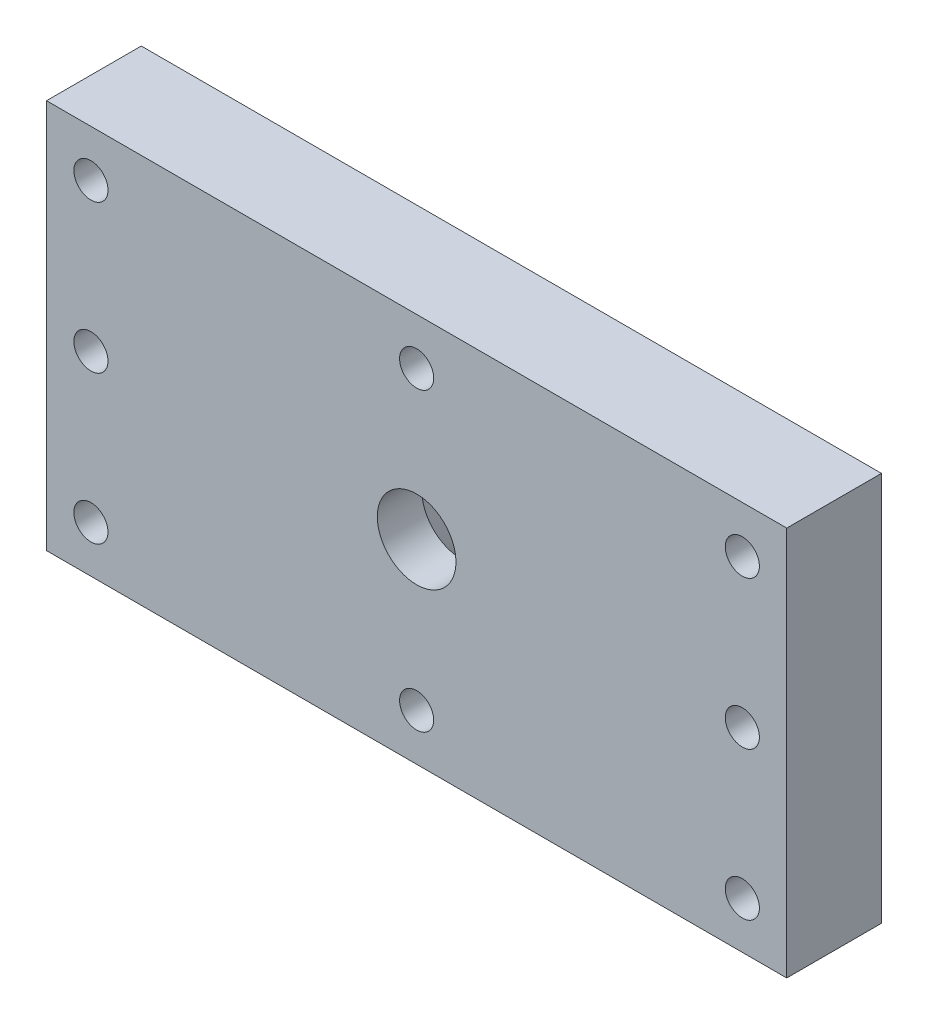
ISO-10303-21;
HEADER;
FILE_DESCRIPTION(('STEP AP214'),'2;1');
FILE_NAME('part.step','',(''),(''),'','','');
FILE_SCHEMA(('AUTOMOTIVE_DESIGN { 1 0 10303 214 1 1 1 1 }'));
ENDSEC;
DATA;
#1=APPLICATION_CONTEXT('core data for automotive mechanical design processes');
#2=APPLICATION_PROTOCOL_DEFINITION('international standard','automotive_design',2000,#1);
#3=PRODUCT_CONTEXT('',#1,'mechanical');
#4=PRODUCT('Part','Part','',(#3));
#5=PRODUCT_RELATED_PRODUCT_CATEGORY('part','',(#4));
#6=PRODUCT_DEFINITION_FORMATION('','',#4);
#7=PRODUCT_DEFINITION_CONTEXT('part definition',#1,'design');
#8=PRODUCT_DEFINITION('design','',#6,#7);
#9=PRODUCT_DEFINITION_SHAPE('','',#8);
#10=(LENGTH_UNIT() NAMED_UNIT(*) SI_UNIT(.MILLI.,.METRE.));
#11=(NAMED_UNIT(*) PLANE_ANGLE_UNIT() SI_UNIT($,.RADIAN.));
#12=(NAMED_UNIT(*) SI_UNIT($,.STERADIAN.) SOLID_ANGLE_UNIT());
#13=UNCERTAINTY_MEASURE_WITH_UNIT(LENGTH_MEASURE(1.E-05),#10,'distance_accuracy_value','');
#14=(GEOMETRIC_REPRESENTATION_CONTEXT(3) GLOBAL_UNCERTAINTY_ASSIGNED_CONTEXT((#13)) GLOBAL_UNIT_ASSIGNED_CONTEXT((#10,
#11,#12)) REPRESENTATION_CONTEXT('',''));
#15=CARTESIAN_POINT('',(0.,0.,0.));
#16=DIRECTION('',(0.,0.,1.));
#17=DIRECTION('',(1.,0.,0.));
#18=AXIS2_PLACEMENT_3D('',#15,#16,#17);
#19=CARTESIAN_POINT('',(39.6875,20.8915,10.16));
#20=DIRECTION('',(-1.,0.,0.));
#21=DIRECTION('',(0.,0.,1.));
#22=AXIS2_PLACEMENT_3D('',#19,#20,#21);
#23=PLANE('',#22);
#24=DIRECTION('',(0.,1.,0.));
#25=VECTOR('',#24,1.);
#26=CARTESIAN_POINT('',(39.6875,20.8915,0.));
#27=LINE('',#26,#25);
#28=CARTESIAN_POINT('',(39.6875,-20.8915,0.));
#29=VERTEX_POINT('',#28);
#30=CARTESIAN_POINT('',(39.6875,20.8915,0.));
#31=VERTEX_POINT('',#30);
#32=EDGE_CURVE('E96',#29,#31,#27,.T.);
#33=ORIENTED_EDGE('',*,*,#32,.T.);
#34=DIRECTION('',(0.,0.,-1.));
#35=VECTOR('',#34,1.);
#36=CARTESIAN_POINT('',(39.6875,20.8915,10.16));
#37=LINE('',#36,#35);
#38=CARTESIAN_POINT('',(39.6875,20.8915,10.16));
#39=VERTEX_POINT('',#38);
#40=EDGE_CURVE('E11',#39,#31,#37,.T.);
#41=ORIENTED_EDGE('',*,*,#40,.F.);
#42=DIRECTION('',(0.,1.,0.));
#43=VECTOR('',#42,1.);
#44=CARTESIAN_POINT('',(39.6875,20.8915,10.16));
#45=LINE('',#44,#43);
#46=CARTESIAN_POINT('',(39.6875,-20.8915,10.16));
#47=VERTEX_POINT('',#46);
#48=EDGE_CURVE('E84',#47,#39,#45,.T.);
#49=ORIENTED_EDGE('',*,*,#48,.F.);
#50=DIRECTION('',(0.,0.,-1.));
#51=VECTOR('',#50,1.);
#52=CARTESIAN_POINT('',(39.6875,-20.8915,10.16));
#53=LINE('',#52,#51);
#54=EDGE_CURVE('E92',#47,#29,#53,.T.);
#55=ORIENTED_EDGE('',*,*,#54,.T.);
#56=EDGE_LOOP('',(#33,#41,#49,#55));
#57=FACE_BOUND('',#56,.T.);
#58=ADVANCED_FACE('F33',(#57),#23,.F.);
#59=CARTESIAN_POINT('',(-39.6875,20.8915,10.16));
#60=DIRECTION('',(0.,-1.,0.));
#61=DIRECTION('',(0.,0.,-1.));
#62=AXIS2_PLACEMENT_3D('',#59,#60,#61);
#63=PLANE('',#62);
#64=DIRECTION('',(-1.,0.,0.));
#65=VECTOR('',#64,1.);
#66=CARTESIAN_POINT('',(-39.6875,20.8915,0.));
#67=LINE('',#66,#65);
#68=CARTESIAN_POINT('',(-39.6875,20.8915,0.));
#69=VERTEX_POINT('',#68);
#70=EDGE_CURVE('E88',#31,#69,#67,.T.);
#71=ORIENTED_EDGE('',*,*,#70,.T.);
#72=DIRECTION('',(0.,0.,-1.));
#73=VECTOR('',#72,1.);
#74=CARTESIAN_POINT('',(-39.6875,20.8915,10.16));
#75=LINE('',#74,#73);
#76=CARTESIAN_POINT('',(-39.6875,20.8915,10.16));
#77=VERTEX_POINT('',#76);
#78=EDGE_CURVE('E41',#77,#69,#75,.T.);
#79=ORIENTED_EDGE('',*,*,#78,.F.);
#80=DIRECTION('',(-1.,0.,0.));
#81=VECTOR('',#80,1.);
#82=CARTESIAN_POINT('',(-39.6875,20.8915,10.16));
#83=LINE('',#82,#81);
#84=EDGE_CURVE('E79',#39,#77,#83,.T.);
#85=ORIENTED_EDGE('',*,*,#84,.F.);
#86=ORIENTED_EDGE('',*,*,#40,.T.);
#87=EDGE_LOOP('',(#71,#79,#85,#86));
#88=FACE_BOUND('',#87,.T.);
#89=ADVANCED_FACE('F87',(#88),#63,.F.);
#90=CARTESIAN_POINT('',(-39.6875,20.8915,10.16));
#91=DIRECTION('',(1.,0.,0.));
#92=DIRECTION('',(0.,0.,-1.));
#93=AXIS2_PLACEMENT_3D('',#90,#91,#92);
#94=PLANE('',#93);
#95=DIRECTION('',(0.,-1.,0.));
#96=VECTOR('',#95,1.);
#97=CARTESIAN_POINT('',(-39.6875,20.8915,0.));
#98=LINE('',#97,#96);
#99=CARTESIAN_POINT('',(-39.6875,-20.8915,0.));
#100=VERTEX_POINT('',#99);
#101=EDGE_CURVE('E66',#69,#100,#98,.T.);
#102=ORIENTED_EDGE('',*,*,#101,.T.);
#103=DIRECTION('',(0.,0.,-1.));
#104=VECTOR('',#103,1.);
#105=CARTESIAN_POINT('',(-39.6875,-20.8915,10.16));
#106=LINE('',#105,#104);
#107=CARTESIAN_POINT('',(-39.6875,-20.8915,10.16));
#108=VERTEX_POINT('',#107);
#109=EDGE_CURVE('E89',#108,#100,#106,.T.);
#110=ORIENTED_EDGE('',*,*,#109,.F.);
#111=DIRECTION('',(0.,-1.,0.));
#112=VECTOR('',#111,1.);
#113=CARTESIAN_POINT('',(-39.6875,20.8915,10.16));
#114=LINE('',#113,#112);
#115=EDGE_CURVE('E82',#77,#108,#114,.T.);
#116=ORIENTED_EDGE('',*,*,#115,.F.);
#117=ORIENTED_EDGE('',*,*,#78,.T.);
#118=EDGE_LOOP('',(#102,#110,#116,#117));
#119=FACE_BOUND('',#118,.T.);
#120=ADVANCED_FACE('F90',(#119),#94,.F.);
#121=CARTESIAN_POINT('',(-39.6875,-20.8915,10.16));
#122=DIRECTION('',(0.,1.,0.));
#123=DIRECTION('',(0.,0.,1.));
#124=AXIS2_PLACEMENT_3D('',#121,#122,#123);
#125=PLANE('',#124);
#126=DIRECTION('',(1.,0.,0.));
#127=VECTOR('',#126,1.);
#128=CARTESIAN_POINT('',(-39.6875,-20.8915,0.));
#129=LINE('',#128,#127);
#130=EDGE_CURVE('E72',#100,#29,#129,.T.);
#131=ORIENTED_EDGE('',*,*,#130,.T.);
#132=ORIENTED_EDGE('',*,*,#54,.F.);
#133=DIRECTION('',(1.,0.,0.));
#134=VECTOR('',#133,1.);
#135=CARTESIAN_POINT('',(-39.6875,-20.8915,10.16));
#136=LINE('',#135,#134);
#137=EDGE_CURVE('E49',#108,#47,#136,.T.);
#138=ORIENTED_EDGE('',*,*,#137,.F.);
#139=ORIENTED_EDGE('',*,*,#109,.T.);
#140=EDGE_LOOP('',(#131,#132,#138,#139));
#141=FACE_BOUND('',#140,.T.);
#142=ADVANCED_FACE('F104',(#141),#125,.F.);
#143=CARTESIAN_POINT('',(0.,0.,10.16));
#144=DIRECTION('',(0.,0.,1.));
#145=DIRECTION('',(1.,0.,0.));
#146=AXIS2_PLACEMENT_3D('',#143,#144,#145);
#147=PLANE('',#146);
#148=CARTESIAN_POINT('',(-34.925,15.875,10.16));
#149=DIRECTION('',(0.,0.,1.));
#150=DIRECTION('',(1.,0.,0.));
#151=AXIS2_PLACEMENT_3D('',#148,#149,#150);
#152=CIRCLE('',#151,1.82879999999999);
#153=CARTESIAN_POINT('',(-33.0962,15.875,10.16));
#154=VERTEX_POINT('',#153);
#155=EDGE_CURVE('E163',#154,#154,#152,.T.);
#156=ORIENTED_EDGE('',*,*,#155,.F.);
#157=EDGE_LOOP('',(#156));
#158=FACE_BOUND('',#157,.T.);
#159=CARTESIAN_POINT('',(-34.925,0.,10.16));
#160=DIRECTION('',(0.,0.,1.));
#161=DIRECTION('',(1.,0.,0.));
#162=AXIS2_PLACEMENT_3D('',#159,#160,#161);
#163=CIRCLE('',#162,1.82879999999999);
#164=CARTESIAN_POINT('',(-33.0962,0.,10.16));
#165=VERTEX_POINT('',#164);
#166=EDGE_CURVE('E157',#165,#165,#163,.T.);
#167=ORIENTED_EDGE('',*,*,#166,.F.);
#168=EDGE_LOOP('',(#167));
#169=FACE_BOUND('',#168,.T.);
#170=CARTESIAN_POINT('',(-34.925,-15.875,10.16));
#171=DIRECTION('',(0.,0.,1.));
#172=DIRECTION('',(1.,0.,0.));
#173=AXIS2_PLACEMENT_3D('',#170,#171,#172);
#174=CIRCLE('',#173,1.82879999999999);
#175=CARTESIAN_POINT('',(-33.0962,-15.875,10.16));
#176=VERTEX_POINT('',#175);
#177=EDGE_CURVE('E151',#176,#176,#174,.T.);
#178=ORIENTED_EDGE('',*,*,#177,.F.);
#179=EDGE_LOOP('',(#178));
#180=FACE_BOUND('',#179,.T.);
#181=CARTESIAN_POINT('',(0.,-15.875,10.16));
#182=DIRECTION('',(0.,0.,1.));
#183=DIRECTION('',(1.,0.,0.));
#184=AXIS2_PLACEMENT_3D('',#181,#182,#183);
#185=CIRCLE('',#184,1.82879999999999);
#186=CARTESIAN_POINT('',(1.82879999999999,-15.875,10.16));
#187=VERTEX_POINT('',#186);
#188=EDGE_CURVE('E145',#187,#187,#185,.T.);
#189=ORIENTED_EDGE('',*,*,#188,.F.);
#190=EDGE_LOOP('',(#189));
#191=FACE_BOUND('',#190,.T.);
#192=CARTESIAN_POINT('',(34.925,-15.875,10.16));
#193=DIRECTION('',(0.,0.,1.));
#194=DIRECTION('',(1.,0.,0.));
#195=AXIS2_PLACEMENT_3D('',#192,#193,#194);
#196=CIRCLE('',#195,1.82879999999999);
#197=CARTESIAN_POINT('',(36.7538,-15.875,10.16));
#198=VERTEX_POINT('',#197);
#199=EDGE_CURVE('E139',#198,#198,#196,.T.);
#200=ORIENTED_EDGE('',*,*,#199,.F.);
#201=EDGE_LOOP('',(#200));
#202=FACE_BOUND('',#201,.T.);
#203=CARTESIAN_POINT('',(34.925,0.,10.16));
#204=DIRECTION('',(0.,0.,1.));
#205=DIRECTION('',(1.,0.,0.));
#206=AXIS2_PLACEMENT_3D('',#203,#204,#205);
#207=CIRCLE('',#206,1.82879999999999);
#208=CARTESIAN_POINT('',(36.7538,0.,10.16));
#209=VERTEX_POINT('',#208);
#210=EDGE_CURVE('E133',#209,#209,#207,.T.);
#211=ORIENTED_EDGE('',*,*,#210,.F.);
#212=EDGE_LOOP('',(#211));
#213=FACE_BOUND('',#212,.T.);
#214=CARTESIAN_POINT('',(34.925,15.875,10.16));
#215=DIRECTION('',(0.,0.,1.));
#216=DIRECTION('',(1.,0.,0.));
#217=AXIS2_PLACEMENT_3D('',#214,#215,#216);
#218=CIRCLE('',#217,1.82879999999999);
#219=CARTESIAN_POINT('',(36.7538,15.875,10.16));
#220=VERTEX_POINT('',#219);
#221=EDGE_CURVE('E127',#220,#220,#218,.T.);
#222=ORIENTED_EDGE('',*,*,#221,.F.);
#223=EDGE_LOOP('',(#222));
#224=FACE_BOUND('',#223,.T.);
#225=CARTESIAN_POINT('',(0.,15.875,10.16));
#226=DIRECTION('',(0.,0.,1.));
#227=DIRECTION('',(1.,0.,0.));
#228=AXIS2_PLACEMENT_3D('',#225,#226,#227);
#229=CIRCLE('',#228,1.82879999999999);
#230=CARTESIAN_POINT('',(1.82879999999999,15.875,10.16));
#231=VERTEX_POINT('',#230);
#232=EDGE_CURVE('E121',#231,#231,#229,.T.);
#233=ORIENTED_EDGE('',*,*,#232,.F.);
#234=EDGE_LOOP('',(#233));
#235=FACE_BOUND('',#234,.T.);
#236=CARTESIAN_POINT('',(0.,0.,10.16));
#237=DIRECTION('',(0.,0.,-1.));
#238=DIRECTION('',(-1.,0.,0.));
#239=AXIS2_PLACEMENT_3D('',#236,#237,#238);
#240=CIRCLE('',#239,4.2164);
#241=CARTESIAN_POINT('',(-4.2164,0.,10.16));
#242=VERTEX_POINT('',#241);
#243=EDGE_CURVE('E99',#242,#242,#240,.T.);
#244=ORIENTED_EDGE('',*,*,#243,.T.);
#245=EDGE_LOOP('',(#244));
#246=FACE_BOUND('',#245,.T.);
#247=ORIENTED_EDGE('',*,*,#48,.T.);
#248=ORIENTED_EDGE('',*,*,#84,.T.);
#249=ORIENTED_EDGE('',*,*,#115,.T.);
#250=ORIENTED_EDGE('',*,*,#137,.T.);
#251=EDGE_LOOP('',(#247,#248,#249,#250));
#252=FACE_BOUND('',#251,.T.);
#253=ADVANCED_FACE('F80',(#158,#169,#180,#191,#202,#213,#224,#235,#246,#252),#147,.T.);
#254=CARTESIAN_POINT('',(0.,0.,0.));
#255=DIRECTION('',(0.,0.,1.));
#256=DIRECTION('',(1.,0.,0.));
#257=AXIS2_PLACEMENT_3D('',#254,#255,#256);
#258=PLANE('',#257);
#259=CARTESIAN_POINT('',(-34.925,15.875,0.));
#260=DIRECTION('',(0.,0.,1.));
#261=DIRECTION('',(1.,0.,0.));
#262=AXIS2_PLACEMENT_3D('',#259,#260,#261);
#263=CIRCLE('',#262,1.8288);
#264=CARTESIAN_POINT('',(-33.0962,15.875,0.));
#265=VERTEX_POINT('',#264);
#266=EDGE_CURVE('E160',#265,#265,#263,.T.);
#267=ORIENTED_EDGE('',*,*,#266,.T.);
#268=EDGE_LOOP('',(#267));
#269=FACE_BOUND('',#268,.T.);
#270=CARTESIAN_POINT('',(-34.925,0.,0.));
#271=DIRECTION('',(0.,0.,1.));
#272=DIRECTION('',(1.,0.,0.));
#273=AXIS2_PLACEMENT_3D('',#270,#271,#272);
#274=CIRCLE('',#273,1.8288);
#275=CARTESIAN_POINT('',(-33.0962,0.,0.));
#276=VERTEX_POINT('',#275);
#277=EDGE_CURVE('E154',#276,#276,#274,.T.);
#278=ORIENTED_EDGE('',*,*,#277,.T.);
#279=EDGE_LOOP('',(#278));
#280=FACE_BOUND('',#279,.T.);
#281=CARTESIAN_POINT('',(-34.925,-15.875,0.));
#282=DIRECTION('',(0.,0.,1.));
#283=DIRECTION('',(1.,0.,0.));
#284=AXIS2_PLACEMENT_3D('',#281,#282,#283);
#285=CIRCLE('',#284,1.8288);
#286=CARTESIAN_POINT('',(-33.0962,-15.875,0.));
#287=VERTEX_POINT('',#286);
#288=EDGE_CURVE('E148',#287,#287,#285,.T.);
#289=ORIENTED_EDGE('',*,*,#288,.T.);
#290=EDGE_LOOP('',(#289));
#291=FACE_BOUND('',#290,.T.);
#292=CARTESIAN_POINT('',(0.,-15.875,0.));
#293=DIRECTION('',(0.,0.,1.));
#294=DIRECTION('',(1.,0.,0.));
#295=AXIS2_PLACEMENT_3D('',#292,#293,#294);
#296=CIRCLE('',#295,1.8288);
#297=CARTESIAN_POINT('',(1.8288,-15.875,0.));
#298=VERTEX_POINT('',#297);
#299=EDGE_CURVE('E142',#298,#298,#296,.T.);
#300=ORIENTED_EDGE('',*,*,#299,.T.);
#301=EDGE_LOOP('',(#300));
#302=FACE_BOUND('',#301,.T.);
#303=CARTESIAN_POINT('',(34.925,-15.875,0.));
#304=DIRECTION('',(0.,0.,1.));
#305=DIRECTION('',(1.,0.,0.));
#306=AXIS2_PLACEMENT_3D('',#303,#304,#305);
#307=CIRCLE('',#306,1.8288);
#308=CARTESIAN_POINT('',(36.7538,-15.875,0.));
#309=VERTEX_POINT('',#308);
#310=EDGE_CURVE('E136',#309,#309,#307,.T.);
#311=ORIENTED_EDGE('',*,*,#310,.T.);
#312=EDGE_LOOP('',(#311));
#313=FACE_BOUND('',#312,.T.);
#314=CARTESIAN_POINT('',(34.925,0.,0.));
#315=DIRECTION('',(0.,0.,1.));
#316=DIRECTION('',(1.,0.,0.));
#317=AXIS2_PLACEMENT_3D('',#314,#315,#316);
#318=CIRCLE('',#317,1.8288);
#319=CARTESIAN_POINT('',(36.7538,0.,0.));
#320=VERTEX_POINT('',#319);
#321=EDGE_CURVE('E130',#320,#320,#318,.T.);
#322=ORIENTED_EDGE('',*,*,#321,.T.);
#323=EDGE_LOOP('',(#322));
#324=FACE_BOUND('',#323,.T.);
#325=CARTESIAN_POINT('',(34.925,15.875,0.));
#326=DIRECTION('',(0.,0.,1.));
#327=DIRECTION('',(1.,0.,0.));
#328=AXIS2_PLACEMENT_3D('',#325,#326,#327);
#329=CIRCLE('',#328,1.8288);
#330=CARTESIAN_POINT('',(36.7538,15.875,0.));
#331=VERTEX_POINT('',#330);
#332=EDGE_CURVE('E124',#331,#331,#329,.T.);
#333=ORIENTED_EDGE('',*,*,#332,.T.);
#334=EDGE_LOOP('',(#333));
#335=FACE_BOUND('',#334,.T.);
#336=CARTESIAN_POINT('',(0.,15.875,0.));
#337=DIRECTION('',(0.,0.,1.));
#338=DIRECTION('',(1.,0.,0.));
#339=AXIS2_PLACEMENT_3D('',#336,#337,#338);
#340=CIRCLE('',#339,1.8288);
#341=CARTESIAN_POINT('',(1.8288,15.875,0.));
#342=VERTEX_POINT('',#341);
#343=EDGE_CURVE('E118',#342,#342,#340,.T.);
#344=ORIENTED_EDGE('',*,*,#343,.T.);
#345=EDGE_LOOP('',(#344));
#346=FACE_BOUND('',#345,.T.);
#347=CARTESIAN_POINT('',(0.,0.,0.));
#348=DIRECTION('',(0.,0.,-1.));
#349=DIRECTION('',(-1.,0.,0.));
#350=AXIS2_PLACEMENT_3D('',#347,#348,#349);
#351=CIRCLE('',#350,8.89);
#352=CARTESIAN_POINT('',(-8.89,0.,0.));
#353=VERTEX_POINT('',#352);
#354=EDGE_CURVE('E115',#353,#353,#351,.T.);
#355=ORIENTED_EDGE('',*,*,#354,.F.);
#356=EDGE_LOOP('',(#355));
#357=FACE_BOUND('',#356,.T.);
#358=ORIENTED_EDGE('',*,*,#32,.F.);
#359=ORIENTED_EDGE('',*,*,#130,.F.);
#360=ORIENTED_EDGE('',*,*,#101,.F.);
#361=ORIENTED_EDGE('',*,*,#70,.F.);
#362=EDGE_LOOP('',(#358,#359,#360,#361));
#363=FACE_BOUND('',#362,.T.);
#364=ADVANCED_FACE('F107',(#269,#280,#291,#302,#313,#324,#335,#346,#357,#363),#258,.F.);
#365=CARTESIAN_POINT('',(0.,0.,0.));
#366=DIRECTION('',(0.,0.,-1.));
#367=DIRECTION('',(-1.,0.,0.));
#368=AXIS2_PLACEMENT_3D('',#365,#366,#367);
#369=CYLINDRICAL_SURFACE('',#368,4.2164);
#370=ORIENTED_EDGE('',*,*,#243,.F.);
#371=EDGE_LOOP('',(#370));
#372=FACE_BOUND('',#371,.T.);
#373=CARTESIAN_POINT('',(0.,0.,5.37636178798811));
#374=DIRECTION('',(0.,0.,-1.));
#375=DIRECTION('',(-1.,0.,0.));
#376=AXIS2_PLACEMENT_3D('',#373,#374,#375);
#377=CIRCLE('',#376,4.2164);
#378=CARTESIAN_POINT('',(-4.2164,0.,5.37636178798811));
#379=VERTEX_POINT('',#378);
#380=EDGE_CURVE('E112',#379,#379,#377,.T.);
#381=ORIENTED_EDGE('',*,*,#380,.T.);
#382=EDGE_LOOP('',(#381));
#383=FACE_BOUND('',#382,.T.);
#384=ADVANCED_FACE('F188',(#372,#383),#369,.F.);
#385=CARTESIAN_POINT('',(0.,0.,0.));
#386=DIRECTION('',(0.,0.,-1.));
#387=DIRECTION('',(-1.,0.,0.));
#388=AXIS2_PLACEMENT_3D('',#385,#386,#387);
#389=CONICAL_SURFACE('',#388,8.89,0.715584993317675);
#390=ORIENTED_EDGE('',*,*,#380,.F.);
#391=EDGE_LOOP('',(#390));
#392=FACE_BOUND('',#391,.T.);
#393=ORIENTED_EDGE('',*,*,#354,.T.);
#394=EDGE_LOOP('',(#393));
#395=FACE_BOUND('',#394,.T.);
#396=ADVANCED_FACE('F191',(#392,#395),#389,.F.);
#397=CARTESIAN_POINT('',(0.,15.875,10.16));
#398=DIRECTION('',(0.,0.,1.));
#399=DIRECTION('',(1.,0.,0.));
#400=AXIS2_PLACEMENT_3D('',#397,#398,#399);
#401=CYLINDRICAL_SURFACE('',#400,1.82879999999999);
#402=ORIENTED_EDGE('',*,*,#343,.F.);
#403=EDGE_LOOP('',(#402));
#404=FACE_BOUND('',#403,.T.);
#405=ORIENTED_EDGE('',*,*,#232,.T.);
#406=EDGE_LOOP('',(#405));
#407=FACE_BOUND('',#406,.T.);
#408=ADVANCED_FACE('F197',(#404,#407),#401,.F.);
#409=CARTESIAN_POINT('',(34.925,15.875,10.16));
#410=DIRECTION('',(0.,0.,1.));
#411=DIRECTION('',(1.,0.,0.));
#412=AXIS2_PLACEMENT_3D('',#409,#410,#411);
#413=CYLINDRICAL_SURFACE('',#412,1.8288);
#414=ORIENTED_EDGE('',*,*,#332,.F.);
#415=EDGE_LOOP('',(#414));
#416=FACE_BOUND('',#415,.T.);
#417=ORIENTED_EDGE('',*,*,#221,.T.);
#418=EDGE_LOOP('',(#417));
#419=FACE_BOUND('',#418,.T.);
#420=ADVANCED_FACE('F243',(#416,#419),#413,.F.);
#421=CARTESIAN_POINT('',(34.925,0.,10.16));
#422=DIRECTION('',(0.,0.,1.));
#423=DIRECTION('',(1.,0.,0.));
#424=AXIS2_PLACEMENT_3D('',#421,#422,#423);
#425=CYLINDRICAL_SURFACE('',#424,1.8288);
#426=ORIENTED_EDGE('',*,*,#321,.F.);
#427=EDGE_LOOP('',(#426));
#428=FACE_BOUND('',#427,.T.);
#429=ORIENTED_EDGE('',*,*,#210,.T.);
#430=EDGE_LOOP('',(#429));
#431=FACE_BOUND('',#430,.T.);
#432=ADVANCED_FACE('F253',(#428,#431),#425,.F.);
#433=CARTESIAN_POINT('',(34.925,-15.875,10.16));
#434=DIRECTION('',(0.,0.,1.));
#435=DIRECTION('',(1.,0.,0.));
#436=AXIS2_PLACEMENT_3D('',#433,#434,#435);
#437=CYLINDRICAL_SURFACE('',#436,1.8288);
#438=ORIENTED_EDGE('',*,*,#310,.F.);
#439=EDGE_LOOP('',(#438));
#440=FACE_BOUND('',#439,.T.);
#441=ORIENTED_EDGE('',*,*,#199,.T.);
#442=EDGE_LOOP('',(#441));
#443=FACE_BOUND('',#442,.T.);
#444=ADVANCED_FACE('F263',(#440,#443),#437,.F.);
#445=CARTESIAN_POINT('',(0.,-15.875,10.16));
#446=DIRECTION('',(0.,0.,1.));
#447=DIRECTION('',(1.,0.,0.));
#448=AXIS2_PLACEMENT_3D('',#445,#446,#447);
#449=CYLINDRICAL_SURFACE('',#448,1.82879999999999);
#450=ORIENTED_EDGE('',*,*,#299,.F.);
#451=EDGE_LOOP('',(#450));
#452=FACE_BOUND('',#451,.T.);
#453=ORIENTED_EDGE('',*,*,#188,.T.);
#454=EDGE_LOOP('',(#453));
#455=FACE_BOUND('',#454,.T.);
#456=ADVANCED_FACE('F273',(#452,#455),#449,.F.);
#457=CARTESIAN_POINT('',(-34.925,-15.875,10.16));
#458=DIRECTION('',(0.,0.,1.));
#459=DIRECTION('',(1.,0.,0.));
#460=AXIS2_PLACEMENT_3D('',#457,#458,#459);
#461=CYLINDRICAL_SURFACE('',#460,1.8288);
#462=ORIENTED_EDGE('',*,*,#288,.F.);
#463=EDGE_LOOP('',(#462));
#464=FACE_BOUND('',#463,.T.);
#465=ORIENTED_EDGE('',*,*,#177,.T.);
#466=EDGE_LOOP('',(#465));
#467=FACE_BOUND('',#466,.T.);
#468=ADVANCED_FACE('F283',(#464,#467),#461,.F.);
#469=CARTESIAN_POINT('',(-34.925,0.,10.16));
#470=DIRECTION('',(0.,0.,1.));
#471=DIRECTION('',(1.,0.,0.));
#472=AXIS2_PLACEMENT_3D('',#469,#470,#471);
#473=CYLINDRICAL_SURFACE('',#472,1.8288);
#474=ORIENTED_EDGE('',*,*,#277,.F.);
#475=EDGE_LOOP('',(#474));
#476=FACE_BOUND('',#475,.T.);
#477=ORIENTED_EDGE('',*,*,#166,.T.);
#478=EDGE_LOOP('',(#477));
#479=FACE_BOUND('',#478,.T.);
#480=ADVANCED_FACE('F293',(#476,#479),#473,.F.);
#481=CARTESIAN_POINT('',(-34.925,15.875,10.16));
#482=DIRECTION('',(0.,0.,1.));
#483=DIRECTION('',(1.,0.,0.));
#484=AXIS2_PLACEMENT_3D('',#481,#482,#483);
#485=CYLINDRICAL_SURFACE('',#484,1.8288);
#486=ORIENTED_EDGE('',*,*,#266,.F.);
#487=EDGE_LOOP('',(#486));
#488=FACE_BOUND('',#487,.T.);
#489=ORIENTED_EDGE('',*,*,#155,.T.);
#490=EDGE_LOOP('',(#489));
#491=FACE_BOUND('',#490,.T.);
#492=ADVANCED_FACE('F167',(#488,#491),#485,.F.);
#493=CLOSED_SHELL('',(#58,#89,#120,#142,#253,#364,#384,#396,#408,#420,#432,#444,#456,#468,#480,#492));
#494=MANIFOLD_SOLID_BREP('B2',#493);
#495=ADVANCED_BREP_SHAPE_REPRESENTATION('',(#18,#494),#14);
#496=SHAPE_DEFINITION_REPRESENTATION(#9,#495);
ENDSEC;
END-ISO-10303-21;
